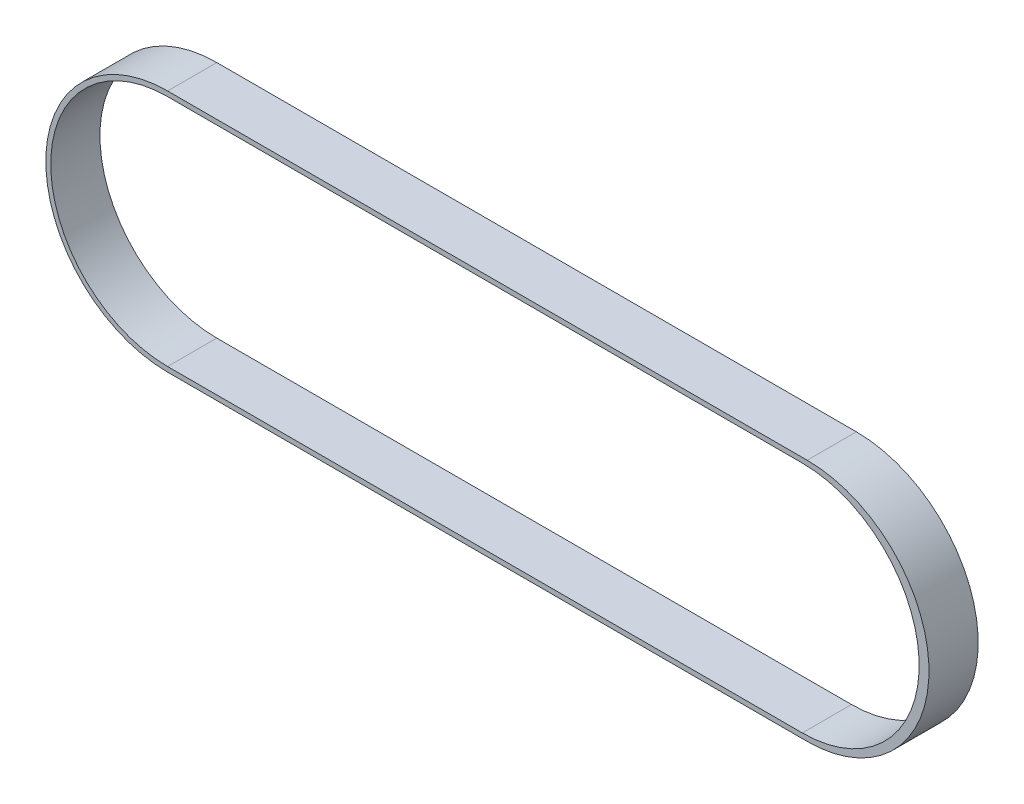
ISO-10303-21;
HEADER;
FILE_DESCRIPTION(('STEP AP214'),'2;1');
FILE_NAME('part.step','',(''),(''),'','','');
FILE_SCHEMA(('AUTOMOTIVE_DESIGN { 1 0 10303 214 1 1 1 1 }'));
ENDSEC;
DATA;
#1=APPLICATION_CONTEXT('core data for automotive mechanical design processes');
#2=APPLICATION_PROTOCOL_DEFINITION('international standard','automotive_design',2000,#1);
#3=PRODUCT_CONTEXT('',#1,'mechanical');
#4=PRODUCT('Part','Part','',(#3));
#5=PRODUCT_RELATED_PRODUCT_CATEGORY('part','',(#4));
#6=PRODUCT_DEFINITION_FORMATION('','',#4);
#7=PRODUCT_DEFINITION_CONTEXT('part definition',#1,'design');
#8=PRODUCT_DEFINITION('design','',#6,#7);
#9=PRODUCT_DEFINITION_SHAPE('','',#8);
#10=(LENGTH_UNIT() NAMED_UNIT(*) SI_UNIT(.MILLI.,.METRE.));
#11=(NAMED_UNIT(*) PLANE_ANGLE_UNIT() SI_UNIT($,.RADIAN.));
#12=(NAMED_UNIT(*) SI_UNIT($,.STERADIAN.) SOLID_ANGLE_UNIT());
#13=UNCERTAINTY_MEASURE_WITH_UNIT(LENGTH_MEASURE(1.E-05),#10,'distance_accuracy_value','');
#14=(GEOMETRIC_REPRESENTATION_CONTEXT(3) GLOBAL_UNCERTAINTY_ASSIGNED_CONTEXT((#13)) GLOBAL_UNIT_ASSIGNED_CONTEXT((#10,
#11,#12)) REPRESENTATION_CONTEXT('',''));
#15=CARTESIAN_POINT('',(0.,0.,0.));
#16=DIRECTION('',(0.,0.,1.));
#17=DIRECTION('',(1.,0.,0.));
#18=AXIS2_PLACEMENT_3D('',#15,#16,#17);
#19=CARTESIAN_POINT('',(0.,0.,12.7));
#20=DIRECTION('',(0.,0.,-1.));
#21=DIRECTION('',(-1.,0.,0.));
#22=AXIS2_PLACEMENT_3D('',#19,#20,#21);
#23=CYLINDRICAL_SURFACE('',#22,31.4325);
#24=CARTESIAN_POINT('',(0.,0.,0.));
#25=DIRECTION('',(0.,0.,1.));
#26=DIRECTION('',(1.,0.,0.));
#27=AXIS2_PLACEMENT_3D('',#24,#25,#26);
#28=CIRCLE('',#27,31.4325);
#29=CARTESIAN_POINT('',(0.,31.4325,0.));
#30=VERTEX_POINT('',#29);
#31=CARTESIAN_POINT('',(0.,-31.4325,0.));
#32=VERTEX_POINT('',#31);
#33=EDGE_CURVE('E130',#30,#32,#28,.T.);
#34=ORIENTED_EDGE('',*,*,#33,.T.);
#35=DIRECTION('',(0.,0.,-1.));
#36=VECTOR('',#35,1.);
#37=CARTESIAN_POINT('',(0.,-31.4325,12.7));
#38=LINE('',#37,#36);
#39=CARTESIAN_POINT('',(0.,-31.4325,12.7));
#40=VERTEX_POINT('',#39);
#41=EDGE_CURVE('E11',#40,#32,#38,.T.);
#42=ORIENTED_EDGE('',*,*,#41,.F.);
#43=CARTESIAN_POINT('',(0.,0.,12.7));
#44=DIRECTION('',(0.,0.,1.));
#45=DIRECTION('',(1.,0.,0.));
#46=AXIS2_PLACEMENT_3D('',#43,#44,#45);
#47=CIRCLE('',#46,31.4325);
#48=CARTESIAN_POINT('',(0.,31.4325,12.7));
#49=VERTEX_POINT('',#48);
#50=EDGE_CURVE('E134',#49,#40,#47,.T.);
#51=ORIENTED_EDGE('',*,*,#50,.F.);
#52=DIRECTION('',(0.,0.,-1.));
#53=VECTOR('',#52,1.);
#54=CARTESIAN_POINT('',(0.,31.4325,12.7));
#55=LINE('',#54,#53);
#56=EDGE_CURVE('E144',#49,#30,#55,.T.);
#57=ORIENTED_EDGE('',*,*,#56,.T.);
#58=EDGE_LOOP('',(#34,#42,#51,#57));
#59=FACE_BOUND('',#58,.T.);
#60=ADVANCED_FACE('F33',(#59),#23,.T.);
#61=CARTESIAN_POINT('',(0.,-31.4325,12.7));
#62=DIRECTION('',(0.,1.,0.));
#63=DIRECTION('',(0.,0.,1.));
#64=AXIS2_PLACEMENT_3D('',#61,#62,#63);
#65=PLANE('',#64);
#66=DIRECTION('',(1.,0.,0.));
#67=VECTOR('',#66,1.);
#68=CARTESIAN_POINT('',(0.,-31.4325,0.));
#69=LINE('',#68,#67);
#70=CARTESIAN_POINT('',(165.1,-31.4325,0.));
#71=VERTEX_POINT('',#70);
#72=EDGE_CURVE('E147',#32,#71,#69,.T.);
#73=ORIENTED_EDGE('',*,*,#72,.T.);
#74=DIRECTION('',(0.,0.,-1.));
#75=VECTOR('',#74,1.);
#76=CARTESIAN_POINT('',(165.1,-31.4325,12.7));
#77=LINE('',#76,#75);
#78=CARTESIAN_POINT('',(165.1,-31.4325,12.7));
#79=VERTEX_POINT('',#78);
#80=EDGE_CURVE('E40',#79,#71,#77,.T.);
#81=ORIENTED_EDGE('',*,*,#80,.F.);
#82=DIRECTION('',(1.,0.,0.));
#83=VECTOR('',#82,1.);
#84=CARTESIAN_POINT('',(0.,-31.4325,12.7));
#85=LINE('',#84,#83);
#86=EDGE_CURVE('E137',#40,#79,#85,.T.);
#87=ORIENTED_EDGE('',*,*,#86,.F.);
#88=ORIENTED_EDGE('',*,*,#41,.T.);
#89=EDGE_LOOP('',(#73,#81,#87,#88));
#90=FACE_BOUND('',#89,.T.);
#91=ADVANCED_FACE('F175',(#90),#65,.F.);
#92=CARTESIAN_POINT('',(165.1,0.,12.7));
#93=DIRECTION('',(0.,0.,-1.));
#94=DIRECTION('',(-1.,0.,0.));
#95=AXIS2_PLACEMENT_3D('',#92,#93,#94);
#96=CYLINDRICAL_SURFACE('',#95,31.4325);
#97=CARTESIAN_POINT('',(165.1,0.,0.));
#98=DIRECTION('',(0.,0.,1.));
#99=DIRECTION('',(1.,0.,0.));
#100=AXIS2_PLACEMENT_3D('',#97,#98,#99);
#101=CIRCLE('',#100,31.4325);
#102=CARTESIAN_POINT('',(165.1,31.4325,0.));
#103=VERTEX_POINT('',#102);
#104=EDGE_CURVE('E149',#71,#103,#101,.T.);
#105=ORIENTED_EDGE('',*,*,#104,.T.);
#106=DIRECTION('',(0.,0.,-1.));
#107=VECTOR('',#106,1.);
#108=CARTESIAN_POINT('',(165.1,31.4325,12.7));
#109=LINE('',#108,#107);
#110=CARTESIAN_POINT('',(165.1,31.4325,12.7));
#111=VERTEX_POINT('',#110);
#112=EDGE_CURVE('E154',#111,#103,#109,.T.);
#113=ORIENTED_EDGE('',*,*,#112,.F.);
#114=CARTESIAN_POINT('',(165.1,0.,12.7));
#115=DIRECTION('',(0.,0.,1.));
#116=DIRECTION('',(1.,0.,0.));
#117=AXIS2_PLACEMENT_3D('',#114,#115,#116);
#118=CIRCLE('',#117,31.4325);
#119=EDGE_CURVE('E140',#79,#111,#118,.T.);
#120=ORIENTED_EDGE('',*,*,#119,.F.);
#121=ORIENTED_EDGE('',*,*,#80,.T.);
#122=EDGE_LOOP('',(#105,#113,#120,#121));
#123=FACE_BOUND('',#122,.T.);
#124=ADVANCED_FACE('F161',(#123),#96,.T.);
#125=CARTESIAN_POINT('',(0.,31.4325,12.7));
#126=DIRECTION('',(0.,-1.,0.));
#127=DIRECTION('',(0.,0.,-1.));
#128=AXIS2_PLACEMENT_3D('',#125,#126,#127);
#129=PLANE('',#128);
#130=DIRECTION('',(-1.,0.,0.));
#131=VECTOR('',#130,1.);
#132=CARTESIAN_POINT('',(0.,31.4325,0.));
#133=LINE('',#132,#131);
#134=EDGE_CURVE('E138',#103,#30,#133,.T.);
#135=ORIENTED_EDGE('',*,*,#134,.T.);
#136=ORIENTED_EDGE('',*,*,#56,.F.);
#137=DIRECTION('',(-1.,0.,0.));
#138=VECTOR('',#137,1.);
#139=CARTESIAN_POINT('',(0.,31.4325,12.7));
#140=LINE('',#139,#138);
#141=EDGE_CURVE('E142',#111,#49,#140,.T.);
#142=ORIENTED_EDGE('',*,*,#141,.F.);
#143=ORIENTED_EDGE('',*,*,#112,.T.);
#144=EDGE_LOOP('',(#135,#136,#142,#143));
#145=FACE_BOUND('',#144,.T.);
#146=ADVANCED_FACE('F168',(#145),#129,.F.);
#147=CARTESIAN_POINT('',(0.,0.,12.7));
#148=DIRECTION('',(0.,0.,1.));
#149=DIRECTION('',(1.,0.,0.));
#150=AXIS2_PLACEMENT_3D('',#147,#148,#149);
#151=PLANE('',#150);
#152=CARTESIAN_POINT('',(0.,0.,12.7));
#153=DIRECTION('',(0.,0.,1.));
#154=DIRECTION('',(1.,0.,0.));
#155=AXIS2_PLACEMENT_3D('',#152,#153,#154);
#156=CIRCLE('',#155,30.1625);
#157=CARTESIAN_POINT('',(0.,30.1625,12.7));
#158=VERTEX_POINT('',#157);
#159=CARTESIAN_POINT('',(0.,-30.1625,12.7));
#160=VERTEX_POINT('',#159);
#161=EDGE_CURVE('E47',#158,#160,#156,.T.);
#162=ORIENTED_EDGE('',*,*,#161,.F.);
#163=DIRECTION('',(-1.,0.,0.));
#164=VECTOR('',#163,1.);
#165=CARTESIAN_POINT('',(0.,30.1625,12.7));
#166=LINE('',#165,#164);
#167=CARTESIAN_POINT('',(163.83,30.1625,12.7));
#168=VERTEX_POINT('',#167);
#169=EDGE_CURVE('E115',#168,#158,#166,.T.);
#170=ORIENTED_EDGE('',*,*,#169,.F.);
#171=CARTESIAN_POINT('',(163.83,0.,12.7));
#172=DIRECTION('',(0.,0.,1.));
#173=DIRECTION('',(1.,0.,0.));
#174=AXIS2_PLACEMENT_3D('',#171,#172,#173);
#175=CIRCLE('',#174,30.1625);
#176=CARTESIAN_POINT('',(163.83,-30.1625,12.7));
#177=VERTEX_POINT('',#176);
#178=EDGE_CURVE('E118',#177,#168,#175,.T.);
#179=ORIENTED_EDGE('',*,*,#178,.F.);
#180=DIRECTION('',(1.,0.,0.));
#181=VECTOR('',#180,1.);
#182=CARTESIAN_POINT('',(0.,-30.1625,12.7));
#183=LINE('',#182,#181);
#184=EDGE_CURVE('E124',#160,#177,#183,.T.);
#185=ORIENTED_EDGE('',*,*,#184,.F.);
#186=EDGE_LOOP('',(#162,#170,#179,#185));
#187=FACE_BOUND('',#186,.T.);
#188=ORIENTED_EDGE('',*,*,#50,.T.);
#189=ORIENTED_EDGE('',*,*,#86,.T.);
#190=ORIENTED_EDGE('',*,*,#119,.T.);
#191=ORIENTED_EDGE('',*,*,#141,.T.);
#192=EDGE_LOOP('',(#188,#189,#190,#191));
#193=FACE_BOUND('',#192,.T.);
#194=ADVANCED_FACE('F174',(#187,#193),#151,.T.);
#195=CARTESIAN_POINT('',(0.,0.,0.));
#196=DIRECTION('',(0.,0.,1.));
#197=DIRECTION('',(1.,0.,0.));
#198=AXIS2_PLACEMENT_3D('',#195,#196,#197);
#199=PLANE('',#198);
#200=DIRECTION('',(-1.,0.,0.));
#201=VECTOR('',#200,1.);
#202=CARTESIAN_POINT('',(0.,30.1625,0.));
#203=LINE('',#202,#201);
#204=CARTESIAN_POINT('',(163.83,30.1625,0.));
#205=VERTEX_POINT('',#204);
#206=CARTESIAN_POINT('',(0.,30.1625,0.));
#207=VERTEX_POINT('',#206);
#208=EDGE_CURVE('E105',#205,#207,#203,.T.);
#209=ORIENTED_EDGE('',*,*,#208,.T.);
#210=CARTESIAN_POINT('',(0.,0.,0.));
#211=DIRECTION('',(0.,0.,1.));
#212=DIRECTION('',(1.,0.,0.));
#213=AXIS2_PLACEMENT_3D('',#210,#211,#212);
#214=CIRCLE('',#213,30.1625);
#215=CARTESIAN_POINT('',(0.,-30.1625,0.));
#216=VERTEX_POINT('',#215);
#217=EDGE_CURVE('E99',#207,#216,#214,.T.);
#218=ORIENTED_EDGE('',*,*,#217,.T.);
#219=DIRECTION('',(1.,0.,0.));
#220=VECTOR('',#219,1.);
#221=CARTESIAN_POINT('',(0.,-30.1625,0.));
#222=LINE('',#221,#220);
#223=CARTESIAN_POINT('',(163.83,-30.1625,0.));
#224=VERTEX_POINT('',#223);
#225=EDGE_CURVE('E108',#216,#224,#222,.T.);
#226=ORIENTED_EDGE('',*,*,#225,.T.);
#227=CARTESIAN_POINT('',(163.83,0.,0.));
#228=DIRECTION('',(0.,0.,1.));
#229=DIRECTION('',(1.,0.,0.));
#230=AXIS2_PLACEMENT_3D('',#227,#228,#229);
#231=CIRCLE('',#230,30.1625);
#232=EDGE_CURVE('E55',#224,#205,#231,.T.);
#233=ORIENTED_EDGE('',*,*,#232,.T.);
#234=EDGE_LOOP('',(#209,#218,#226,#233));
#235=FACE_BOUND('',#234,.T.);
#236=ORIENTED_EDGE('',*,*,#33,.F.);
#237=ORIENTED_EDGE('',*,*,#134,.F.);
#238=ORIENTED_EDGE('',*,*,#104,.F.);
#239=ORIENTED_EDGE('',*,*,#72,.F.);
#240=EDGE_LOOP('',(#236,#237,#238,#239));
#241=FACE_BOUND('',#240,.T.);
#242=ADVANCED_FACE('F112',(#235,#241),#199,.F.);
#243=CARTESIAN_POINT('',(0.,0.,0.));
#244=DIRECTION('',(0.,0.,1.));
#245=DIRECTION('',(1.,0.,0.));
#246=AXIS2_PLACEMENT_3D('',#243,#244,#245);
#247=CYLINDRICAL_SURFACE('',#246,30.1625);
#248=ORIENTED_EDGE('',*,*,#161,.T.);
#249=DIRECTION('',(0.,0.,1.));
#250=VECTOR('',#249,1.);
#251=CARTESIAN_POINT('',(0.,-30.1625,0.));
#252=LINE('',#251,#250);
#253=EDGE_CURVE('E95',#216,#160,#252,.T.);
#254=ORIENTED_EDGE('',*,*,#253,.F.);
#255=ORIENTED_EDGE('',*,*,#217,.F.);
#256=DIRECTION('',(0.,0.,1.));
#257=VECTOR('',#256,1.);
#258=CARTESIAN_POINT('',(0.,30.1625,0.));
#259=LINE('',#258,#257);
#260=EDGE_CURVE('E128',#207,#158,#259,.T.);
#261=ORIENTED_EDGE('',*,*,#260,.T.);
#262=EDGE_LOOP('',(#248,#254,#255,#261));
#263=FACE_BOUND('',#262,.T.);
#264=ADVANCED_FACE('F97',(#263),#247,.F.);
#265=CARTESIAN_POINT('',(0.,30.1625,0.));
#266=DIRECTION('',(0.,1.,0.));
#267=DIRECTION('',(0.,0.,1.));
#268=AXIS2_PLACEMENT_3D('',#265,#266,#267);
#269=PLANE('',#268);
#270=ORIENTED_EDGE('',*,*,#169,.T.);
#271=ORIENTED_EDGE('',*,*,#260,.F.);
#272=ORIENTED_EDGE('',*,*,#208,.F.);
#273=DIRECTION('',(0.,0.,1.));
#274=VECTOR('',#273,1.);
#275=CARTESIAN_POINT('',(163.83,30.1625,0.));
#276=LINE('',#275,#274);
#277=EDGE_CURVE('E131',#205,#168,#276,.T.);
#278=ORIENTED_EDGE('',*,*,#277,.T.);
#279=EDGE_LOOP('',(#270,#271,#272,#278));
#280=FACE_BOUND('',#279,.T.);
#281=ADVANCED_FACE('F192',(#280),#269,.F.);
#282=CARTESIAN_POINT('',(163.83,0.,0.));
#283=DIRECTION('',(0.,0.,1.));
#284=DIRECTION('',(1.,0.,0.));
#285=AXIS2_PLACEMENT_3D('',#282,#283,#284);
#286=CYLINDRICAL_SURFACE('',#285,30.1625);
#287=ORIENTED_EDGE('',*,*,#178,.T.);
#288=ORIENTED_EDGE('',*,*,#277,.F.);
#289=ORIENTED_EDGE('',*,*,#232,.F.);
#290=DIRECTION('',(0.,0.,1.));
#291=VECTOR('',#290,1.);
#292=CARTESIAN_POINT('',(163.83,-30.1625,0.));
#293=LINE('',#292,#291);
#294=EDGE_CURVE('E104',#224,#177,#293,.T.);
#295=ORIENTED_EDGE('',*,*,#294,.T.);
#296=EDGE_LOOP('',(#287,#288,#289,#295));
#297=FACE_BOUND('',#296,.T.);
#298=ADVANCED_FACE('F195',(#297),#286,.F.);
#299=CARTESIAN_POINT('',(0.,-30.1625,0.));
#300=DIRECTION('',(0.,-1.,0.));
#301=DIRECTION('',(0.,0.,-1.));
#302=AXIS2_PLACEMENT_3D('',#299,#300,#301);
#303=PLANE('',#302);
#304=ORIENTED_EDGE('',*,*,#184,.T.);
#305=ORIENTED_EDGE('',*,*,#294,.F.);
#306=ORIENTED_EDGE('',*,*,#225,.F.);
#307=ORIENTED_EDGE('',*,*,#253,.T.);
#308=EDGE_LOOP('',(#304,#305,#306,#307));
#309=FACE_BOUND('',#308,.T.);
#310=ADVANCED_FACE('F109',(#309),#303,.F.);
#311=CLOSED_SHELL('',(#60,#91,#124,#146,#194,#242,#264,#281,#298,#310));
#312=MANIFOLD_SOLID_BREP('B2',#311);
#313=ADVANCED_BREP_SHAPE_REPRESENTATION('',(#18,#312),#14);
#314=SHAPE_DEFINITION_REPRESENTATION(#9,#313);
ENDSEC;
END-ISO-10303-21;
